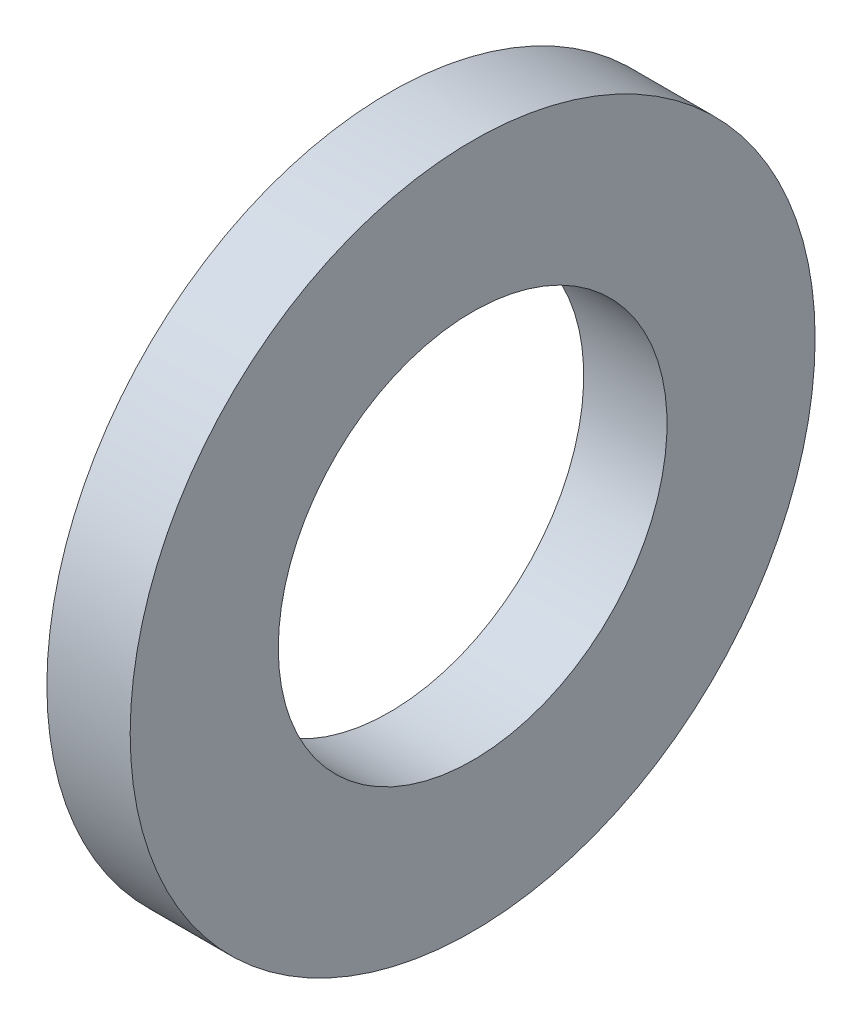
ISO-10303-21;
HEADER;
FILE_DESCRIPTION(('STEP AP214'),'2;1');
FILE_NAME('part.step','',(''),(''),'','','');
FILE_SCHEMA(('AUTOMOTIVE_DESIGN { 1 0 10303 214 1 1 1 1 }'));
ENDSEC;
DATA;
#1=APPLICATION_CONTEXT('core data for automotive mechanical design processes');
#2=APPLICATION_PROTOCOL_DEFINITION('international standard','automotive_design',2000,#1);
#3=PRODUCT_CONTEXT('',#1,'mechanical');
#4=PRODUCT('Part','Part','',(#3));
#5=PRODUCT_RELATED_PRODUCT_CATEGORY('part','',(#4));
#6=PRODUCT_DEFINITION_FORMATION('','',#4);
#7=PRODUCT_DEFINITION_CONTEXT('part definition',#1,'design');
#8=PRODUCT_DEFINITION('design','',#6,#7);
#9=PRODUCT_DEFINITION_SHAPE('','',#8);
#10=(LENGTH_UNIT() NAMED_UNIT(*) SI_UNIT(.MILLI.,.METRE.));
#11=(NAMED_UNIT(*) PLANE_ANGLE_UNIT() SI_UNIT($,.RADIAN.));
#12=(NAMED_UNIT(*) SI_UNIT($,.STERADIAN.) SOLID_ANGLE_UNIT());
#13=UNCERTAINTY_MEASURE_WITH_UNIT(LENGTH_MEASURE(1.E-05),#10,'distance_accuracy_value','');
#14=(GEOMETRIC_REPRESENTATION_CONTEXT(3) GLOBAL_UNCERTAINTY_ASSIGNED_CONTEXT((#13)) GLOBAL_UNIT_ASSIGNED_CONTEXT((#10,
#11,#12)) REPRESENTATION_CONTEXT('',''));
#15=CARTESIAN_POINT('',(0.,0.,0.));
#16=DIRECTION('',(0.,0.,1.));
#17=DIRECTION('',(1.,0.,0.));
#18=AXIS2_PLACEMENT_3D('',#15,#16,#17);
#19=CARTESIAN_POINT('',(-34.9249999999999,0.,0.));
#20=DIRECTION('',(-1.,0.,0.));
#21=DIRECTION('',(0.,0.,1.));
#22=AXIS2_PLACEMENT_3D('',#19,#20,#21);
#23=CYLINDRICAL_SURFACE('',#22,10.5);
#24=CARTESIAN_POINT('',(0.,0.,0.));
#25=DIRECTION('',(-1.,0.,0.));
#26=DIRECTION('',(0.,0.,1.));
#27=AXIS2_PLACEMENT_3D('',#24,#25,#26);
#28=CIRCLE('',#27,10.5);
#29=CARTESIAN_POINT('',(0.,0.,10.5));
#30=VERTEX_POINT('',#29);
#31=EDGE_CURVE('E10',#30,#30,#28,.T.);
#32=ORIENTED_EDGE('',*,*,#31,.F.);
#33=EDGE_LOOP('',(#32));
#34=FACE_BOUND('',#33,.T.);
#35=CARTESIAN_POINT('',(-4.5,0.,0.));
#36=DIRECTION('',(-1.,0.,0.));
#37=DIRECTION('',(0.,0.,1.));
#38=AXIS2_PLACEMENT_3D('',#35,#36,#37);
#39=CIRCLE('',#38,10.5);
#40=CARTESIAN_POINT('',(-4.5,0.,10.5));
#41=VERTEX_POINT('',#40);
#42=EDGE_CURVE('E45',#41,#41,#39,.T.);
#43=ORIENTED_EDGE('',*,*,#42,.T.);
#44=EDGE_LOOP('',(#43));
#45=FACE_BOUND('',#44,.T.);
#46=ADVANCED_FACE('F31',(#34,#45),#23,.F.);
#47=CARTESIAN_POINT('',(0.,10.5,0.));
#48=DIRECTION('',(-1.,0.,0.));
#49=DIRECTION('',(0.,0.,1.));
#50=AXIS2_PLACEMENT_3D('',#47,#48,#49);
#51=PLANE('',#50);
#52=CARTESIAN_POINT('',(0.,0.,0.));
#53=DIRECTION('',(-1.,0.,0.));
#54=DIRECTION('',(0.,0.,1.));
#55=AXIS2_PLACEMENT_3D('',#52,#53,#54);
#56=CIRCLE('',#55,18.5);
#57=CARTESIAN_POINT('',(0.,0.,18.5));
#58=VERTEX_POINT('',#57);
#59=EDGE_CURVE('E37',#58,#58,#56,.T.);
#60=ORIENTED_EDGE('',*,*,#59,.F.);
#61=EDGE_LOOP('',(#60));
#62=FACE_BOUND('',#61,.T.);
#63=ORIENTED_EDGE('',*,*,#31,.T.);
#64=EDGE_LOOP('',(#63));
#65=FACE_BOUND('',#64,.T.);
#66=ADVANCED_FACE('F60',(#62,#65),#51,.F.);
#67=CARTESIAN_POINT('',(-34.9249999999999,0.,0.));
#68=DIRECTION('',(-1.,0.,0.));
#69=DIRECTION('',(0.,0.,1.));
#70=AXIS2_PLACEMENT_3D('',#67,#68,#69);
#71=CYLINDRICAL_SURFACE('',#70,18.5);
#72=CARTESIAN_POINT('',(-4.5,0.,0.));
#73=DIRECTION('',(-1.,0.,0.));
#74=DIRECTION('',(0.,0.,1.));
#75=AXIS2_PLACEMENT_3D('',#72,#73,#74);
#76=CIRCLE('',#75,18.5);
#77=CARTESIAN_POINT('',(-4.5,0.,18.5));
#78=VERTEX_POINT('',#77);
#79=EDGE_CURVE('E41',#78,#78,#76,.T.);
#80=ORIENTED_EDGE('',*,*,#79,.F.);
#81=EDGE_LOOP('',(#80));
#82=FACE_BOUND('',#81,.T.);
#83=ORIENTED_EDGE('',*,*,#59,.T.);
#84=EDGE_LOOP('',(#83));
#85=FACE_BOUND('',#84,.T.);
#86=ADVANCED_FACE('F55',(#82,#85),#71,.T.);
#87=CARTESIAN_POINT('',(-4.5,18.5,0.));
#88=DIRECTION('',(1.,0.,0.));
#89=DIRECTION('',(0.,0.,-1.));
#90=AXIS2_PLACEMENT_3D('',#87,#88,#89);
#91=PLANE('',#90);
#92=ORIENTED_EDGE('',*,*,#42,.F.);
#93=EDGE_LOOP('',(#92));
#94=FACE_BOUND('',#93,.T.);
#95=ORIENTED_EDGE('',*,*,#79,.T.);
#96=EDGE_LOOP('',(#95));
#97=FACE_BOUND('',#96,.T.);
#98=ADVANCED_FACE('F52',(#94,#97),#91,.F.);
#99=CLOSED_SHELL('',(#46,#66,#86,#98));
#100=MANIFOLD_SOLID_BREP('B2',#99);
#101=ADVANCED_BREP_SHAPE_REPRESENTATION('',(#18,#100),#14);
#102=SHAPE_DEFINITION_REPRESENTATION(#9,#101);
ENDSEC;
END-ISO-10303-21;
